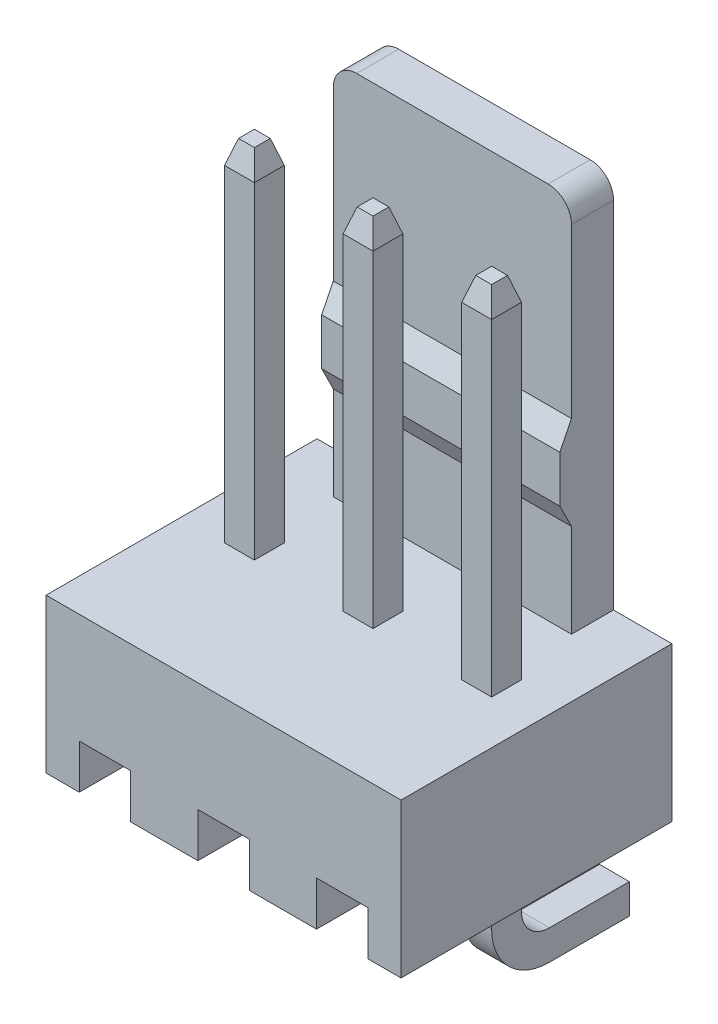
from build123d import *
from OCP.BRepFilletAPI import BRepFilletAPI_MakeChamfer

# Parameters (mm, degrees)
BASE_EXTRUDE_DEPTH  = 3.8
SKETCH2_W           = 2.25
SKETCH2_H           = 9.1
SKETCH2_W_2         = 1.1
SKETCH2_H_2         = 0.95
CUT_EXTRUDE1_DEPTH  = 14.343163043
FILLET1_R           = 0.5
BOSS_EXTRUDE1_START = -4.3
SKETCH3_W           = 0.64
SKETCH3_H           = 0.64
BOSS_EXTRUDE1_DEPTH = 11.8
CHAMFER1_SIZE       = 0.5
CHAMFER1_SIZE2      = 0.15
EXTRUDE_THIN1_DEPTH = 0.64
LPATTERN2_COUNT     = 3
LPATTERN2_PITCH     = 2.54


with BuildPart() as part:
    # Sketch1 → Base-Extrude (new, symmetric)
    with BuildSketch(Plane(origin=(0, 0, 0), x_dir=(0, 0, -1), z_dir=(1, 0, 0))):
        Polygon((2.6, 0), (2.6, 11.4), (1.7, 11.4), (1.7, 7.3), (1.45, 6.8), (1.45, 5.8), (1.7, 5.3), (1.7, 3.3), (-3.2, 3.3), (-3.2, 0), align=None)
    extrude(amount=BASE_EXTRUDE_DEPTH, both=True)

    # Sketch2 → Cut-Extrude1 (cut, through all)
    with BuildSketch(Plane(origin=(0, 0, -2.6), x_dir=(-1, 0, 0), z_dir=(0, 0, -1))):
        with Locations((3.675, 7.85)):
            Rectangle(SKETCH2_W, SKETCH2_H)
        with Locations((-3.675, 7.85)):
            Rectangle(SKETCH2_W, SKETCH2_H)
        with Locations((0, 0.475)):
            Rectangle(SKETCH2_W_2, SKETCH2_H_2)
        with Locations((2.54, 0.475)):
            Rectangle(SKETCH2_W_2, SKETCH2_H_2)
        with Locations((-2.54, 0.475)):
            Rectangle(SKETCH2_W_2, SKETCH2_H_2)
    extrude(amount=-CUT_EXTRUDE1_DEPTH, mode=Mode.SUBTRACT)

    # Fillet1
    fillet1_edges = [part.edges().sort_by_distance(p)[0] for p in [
        (-2.55, 11.4, -2.15),
        (2.55, 11.4, -2.15),
    ]]
    fillet(fillet1_edges, radius=FILLET1_R)

    # Sketch3 → Boss-Extrude1 (add)
    with BuildSketch(Plane(origin=(0, 3.3, 0), x_dir=(-1, 0, 0), z_dir=(0, 1, 0)).offset(BOSS_EXTRUDE1_START)):
        with Locations((2.54, 0)):
            Rectangle(SKETCH3_W, SKETCH3_H)
        Rectangle(SKETCH3_W, SKETCH3_H)
        with Locations((-2.54, 0)):
            Rectangle(SKETCH3_W, SKETCH3_H)
    extrude(amount=BOSS_EXTRUDE1_DEPTH)

    # Chamfer1: one chamfer whose edges measure the first distance from different faces: ONE call of the kernel's chamfer builder (chamfer() names one face for all edges)
    chamfer1_edges_1 = [part.edges().sort_by_distance(p)[0] for p in [
        (0, 10.8, 0.32),
    ]]
    chamfer1_side_1 = [part.faces().sort_by_distance(p)[0] for p in [
        (0, 7.05, 0.32),
    ]]
    chamfer1_edges_2 = [part.edges().sort_by_distance(p)[0] for p in [
        (0.32, 10.8, 0),
    ]]
    chamfer1_side_2 = [part.faces().sort_by_distance(p)[0] for p in [
        (0.32, 7.05, 0),
    ]]
    chamfer1_edges_3 = [part.edges().sort_by_distance(p)[0] for p in [
        (0, 10.8, -0.32),
    ]]
    chamfer1_side_3 = [part.faces().sort_by_distance(p)[0] for p in [
        (0, 7.05, -0.32),
    ]]
    chamfer1_edges_4 = [part.edges().sort_by_distance(p)[0] for p in [
        (-0.32, 10.8, 0),
    ]]
    chamfer1_side_4 = [part.faces().sort_by_distance(p)[0] for p in [
        (-0.32, 7.05, 0),
    ]]
    chamfer1_edges_5 = [part.edges().sort_by_distance(p)[0] for p in [
        (2.54, 10.8, -0.32),
    ]]
    chamfer1_side_5 = [part.faces().sort_by_distance(p)[0] for p in [
        (2.54, 7.05, -0.32),
    ]]
    chamfer1_edges_6 = [part.edges().sort_by_distance(p)[0] for p in [
        (2.22, 10.8, 0),
    ]]
    chamfer1_side_6 = [part.faces().sort_by_distance(p)[0] for p in [
        (2.22, 7.05, 0),
    ]]
    chamfer1_edges_7 = [part.edges().sort_by_distance(p)[0] for p in [
        (2.54, 10.8, 0.32),
    ]]
    chamfer1_side_7 = [part.faces().sort_by_distance(p)[0] for p in [
        (2.54, 7.05, 0.32),
    ]]
    chamfer1_edges_8 = [part.edges().sort_by_distance(p)[0] for p in [
        (2.86, 10.8, 0),
    ]]
    chamfer1_side_8 = [part.faces().sort_by_distance(p)[0] for p in [
        (2.86, 7.05, 0),
    ]]
    chamfer1_edges_9 = [part.edges().sort_by_distance(p)[0] for p in [
        (-2.54, 10.8, 0.32),
    ]]
    chamfer1_side_9 = [part.faces().sort_by_distance(p)[0] for p in [
        (-2.54, 7.05, 0.32),
    ]]
    chamfer1_edges_10 = [part.edges().sort_by_distance(p)[0] for p in [
        (-2.22, 10.8, 0),
    ]]
    chamfer1_side_10 = [part.faces().sort_by_distance(p)[0] for p in [
        (-2.22, 7.05, 0),
    ]]
    chamfer1_edges_11 = [part.edges().sort_by_distance(p)[0] for p in [
        (-2.54, 10.8, -0.32),
    ]]
    chamfer1_side_11 = [part.faces().sort_by_distance(p)[0] for p in [
        (-2.54, 7.05, -0.32),
    ]]
    chamfer1_edges_12 = [part.edges().sort_by_distance(p)[0] for p in [
        (-2.86, 10.8, 0),
    ]]
    chamfer1_side_12 = [part.faces().sort_by_distance(p)[0] for p in [
        (-2.86, 7.05, 0),
    ]]
    chamfer1 = BRepFilletAPI_MakeChamfer(part.part.solid().wrapped)
    for e in chamfer1_edges_1:
        chamfer1.Add(CHAMFER1_SIZE, CHAMFER1_SIZE2, e.wrapped, chamfer1_side_1[0].wrapped)  # the first distance lies on this face
    for e in chamfer1_edges_2:
        chamfer1.Add(CHAMFER1_SIZE, CHAMFER1_SIZE2, e.wrapped, chamfer1_side_2[0].wrapped)  # the first distance lies on this face
    for e in chamfer1_edges_3:
        chamfer1.Add(CHAMFER1_SIZE, CHAMFER1_SIZE2, e.wrapped, chamfer1_side_3[0].wrapped)  # the first distance lies on this face
    for e in chamfer1_edges_4:
        chamfer1.Add(CHAMFER1_SIZE, CHAMFER1_SIZE2, e.wrapped, chamfer1_side_4[0].wrapped)  # the first distance lies on this face
    for e in chamfer1_edges_5:
        chamfer1.Add(CHAMFER1_SIZE, CHAMFER1_SIZE2, e.wrapped, chamfer1_side_5[0].wrapped)  # the first distance lies on this face
    for e in chamfer1_edges_6:
        chamfer1.Add(CHAMFER1_SIZE, CHAMFER1_SIZE2, e.wrapped, chamfer1_side_6[0].wrapped)  # the first distance lies on this face
    for e in chamfer1_edges_7:
        chamfer1.Add(CHAMFER1_SIZE, CHAMFER1_SIZE2, e.wrapped, chamfer1_side_7[0].wrapped)  # the first distance lies on this face
    for e in chamfer1_edges_8:
        chamfer1.Add(CHAMFER1_SIZE, CHAMFER1_SIZE2, e.wrapped, chamfer1_side_8[0].wrapped)  # the first distance lies on this face
    for e in chamfer1_edges_9:
        chamfer1.Add(CHAMFER1_SIZE, CHAMFER1_SIZE2, e.wrapped, chamfer1_side_9[0].wrapped)  # the first distance lies on this face
    for e in chamfer1_edges_10:
        chamfer1.Add(CHAMFER1_SIZE, CHAMFER1_SIZE2, e.wrapped, chamfer1_side_10[0].wrapped)  # the first distance lies on this face
    for e in chamfer1_edges_11:
        chamfer1.Add(CHAMFER1_SIZE, CHAMFER1_SIZE2, e.wrapped, chamfer1_side_11[0].wrapped)  # the first distance lies on this face
    for e in chamfer1_edges_12:
        chamfer1.Add(CHAMFER1_SIZE, CHAMFER1_SIZE2, e.wrapped, chamfer1_side_12[0].wrapped)  # the first distance lies on this face
    add(Compound.cast(chamfer1.Shape()), mode=Mode.REPLACE)

    # Sketch4 → Extrude-Thin1 (add)
    with BuildSketch(Plane(origin=(2.86, 0, 0), x_dir=(0, 0, -1), z_dir=(1, 0, 0))):
        with BuildLine():
            Line((2.63, -1.597769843), (0.917769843, -1.597769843))
            ThreePointArc((0.917769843, -1.597769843), (0.495082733, -1.422687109), (0.32, -1))
            Line((0.32, -1), (-0.32, -1))
            ThreePointArc((-0.32, -1), (0.042534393, -1.875235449), (0.917769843, -2.237769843))
            Line((0.917769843, -2.237769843), (2.63, -2.237769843))
            Line((2.63, -2.237769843), (2.63, -1.597769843))
        make_face()
    extrude_thin1 = extrude(amount=-EXTRUDE_THIN1_DEPTH)

    # LPattern2: Extrude-Thin1 ×3
    with Locations(*[(-i * LPATTERN2_PITCH, 0, 0) for i in range(1, LPATTERN2_COUNT)]):
        add(extrude_thin1)


solid = part.part
